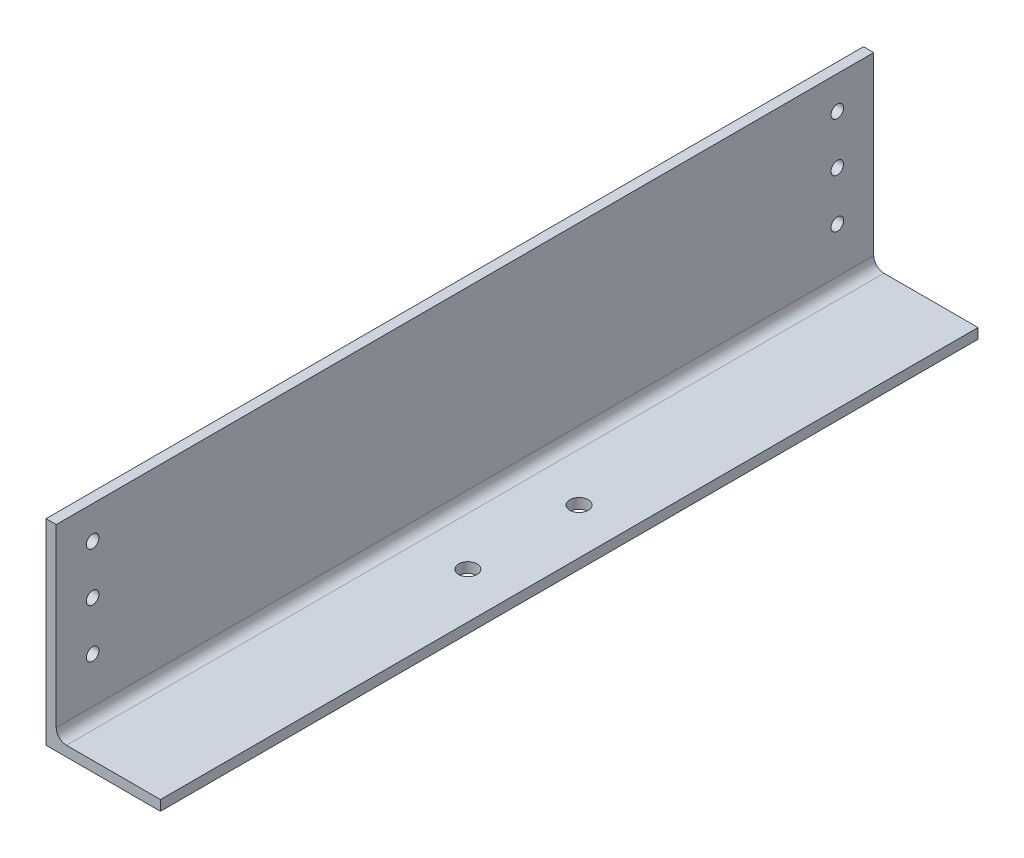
ISO-10303-21;
HEADER;
FILE_DESCRIPTION(('STEP AP214'),'2;1');
FILE_NAME('part.step','',(''),(''),'','','');
FILE_SCHEMA(('AUTOMOTIVE_DESIGN { 1 0 10303 214 1 1 1 1 }'));
ENDSEC;
DATA;
#1=APPLICATION_CONTEXT('core data for automotive mechanical design processes');
#2=APPLICATION_PROTOCOL_DEFINITION('international standard','automotive_design',2000,#1);
#3=PRODUCT_CONTEXT('',#1,'mechanical');
#4=PRODUCT('Part','Part','',(#3));
#5=PRODUCT_RELATED_PRODUCT_CATEGORY('part','',(#4));
#6=PRODUCT_DEFINITION_FORMATION('','',#4);
#7=PRODUCT_DEFINITION_CONTEXT('part definition',#1,'design');
#8=PRODUCT_DEFINITION('design','',#6,#7);
#9=PRODUCT_DEFINITION_SHAPE('','',#8);
#10=(LENGTH_UNIT() NAMED_UNIT(*) SI_UNIT(.MILLI.,.METRE.));
#11=(NAMED_UNIT(*) PLANE_ANGLE_UNIT() SI_UNIT($,.RADIAN.));
#12=(NAMED_UNIT(*) SI_UNIT($,.STERADIAN.) SOLID_ANGLE_UNIT());
#13=UNCERTAINTY_MEASURE_WITH_UNIT(LENGTH_MEASURE(1.E-05),#10,'distance_accuracy_value','');
#14=(GEOMETRIC_REPRESENTATION_CONTEXT(3) GLOBAL_UNCERTAINTY_ASSIGNED_CONTEXT((#13)) GLOBAL_UNIT_ASSIGNED_CONTEXT((#10,
#11,#12)) REPRESENTATION_CONTEXT('',''));
#15=CARTESIAN_POINT('',(0.,0.,0.));
#16=DIRECTION('',(0.,0.,1.));
#17=DIRECTION('',(1.,0.,0.));
#18=AXIS2_PLACEMENT_3D('',#15,#16,#17);
#19=CARTESIAN_POINT('',(69.5846982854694,-50.8356037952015,317.5));
#20=DIRECTION('',(0.,1.,0.));
#21=DIRECTION('',(-1.,0.,0.));
#22=AXIS2_PLACEMENT_3D('',#19,#20,#21);
#23=PLANE('',#22);
#24=CARTESIAN_POINT('',(34.0246982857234,-50.8356037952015,-43.18));
#25=DIRECTION('',(0.,1.,0.));
#26=DIRECTION('',(0.,0.,1.));
#27=AXIS2_PLACEMENT_3D('',#24,#25,#26);
#28=CIRCLE('',#27,7.14374999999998);
#29=CARTESIAN_POINT('',(34.0246982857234,-50.8356037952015,-36.03625));
#30=VERTEX_POINT('',#29);
#31=EDGE_CURVE('E150',#30,#30,#28,.T.);
#32=ORIENTED_EDGE('',*,*,#31,.T.);
#33=EDGE_LOOP('',(#32));
#34=FACE_BOUND('',#33,.T.);
#35=CARTESIAN_POINT('',(34.0246982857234,-50.8356037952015,43.18));
#36=DIRECTION('',(0.,1.,0.));
#37=DIRECTION('',(0.,0.,1.));
#38=AXIS2_PLACEMENT_3D('',#35,#36,#37);
#39=CIRCLE('',#38,7.14374999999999);
#40=CARTESIAN_POINT('',(34.0246982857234,-50.8356037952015,50.32375));
#41=VERTEX_POINT('',#40);
#42=EDGE_CURVE('E156',#41,#41,#39,.T.);
#43=ORIENTED_EDGE('',*,*,#42,.T.);
#44=EDGE_LOOP('',(#43));
#45=FACE_BOUND('',#44,.T.);
#46=DIRECTION('',(1.,0.,0.));
#47=VECTOR('',#46,1.);
#48=CARTESIAN_POINT('',(69.5846982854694,-50.8356037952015,-317.5));
#49=LINE('',#48,#47);
#50=CARTESIAN_POINT('',(-19.3153017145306,-50.8356037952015,-317.5));
#51=VERTEX_POINT('',#50);
#52=CARTESIAN_POINT('',(69.5846982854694,-50.8356037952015,-317.5));
#53=VERTEX_POINT('',#52);
#54=EDGE_CURVE('E127',#51,#53,#49,.T.);
#55=ORIENTED_EDGE('',*,*,#54,.T.);
#56=DIRECTION('',(0.,0.,-1.));
#57=VECTOR('',#56,1.);
#58=CARTESIAN_POINT('',(69.5846982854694,-50.8356037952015,317.5));
#59=LINE('',#58,#57);
#60=CARTESIAN_POINT('',(69.5846982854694,-50.8356037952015,317.5));
#61=VERTEX_POINT('',#60);
#62=EDGE_CURVE('E11',#61,#53,#59,.T.);
#63=ORIENTED_EDGE('',*,*,#62,.F.);
#64=DIRECTION('',(1.,0.,0.));
#65=VECTOR('',#64,1.);
#66=CARTESIAN_POINT('',(69.5846982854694,-50.8356037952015,317.5));
#67=LINE('',#66,#65);
#68=CARTESIAN_POINT('',(-19.3153017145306,-50.8356037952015,317.5));
#69=VERTEX_POINT('',#68);
#70=EDGE_CURVE('E140',#69,#61,#67,.T.);
#71=ORIENTED_EDGE('',*,*,#70,.F.);
#72=DIRECTION('',(0.,0.,-1.));
#73=VECTOR('',#72,1.);
#74=CARTESIAN_POINT('',(-19.3153017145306,-50.8356037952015,317.5));
#75=LINE('',#74,#73);
#76=EDGE_CURVE('E123',#69,#51,#75,.T.);
#77=ORIENTED_EDGE('',*,*,#76,.T.);
#78=EDGE_LOOP('',(#55,#63,#71,#77));
#79=FACE_BOUND('',#78,.T.);
#80=ADVANCED_FACE('F35',(#34,#45,#79),#23,.F.);
#81=CARTESIAN_POINT('',(69.5846982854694,-50.8356037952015,317.5));
#82=DIRECTION('',(-1.,0.,0.));
#83=DIRECTION('',(0.,0.,1.));
#84=AXIS2_PLACEMENT_3D('',#81,#82,#83);
#85=PLANE('',#84);
#86=DIRECTION('',(0.,1.,0.));
#87=VECTOR('',#86,1.);
#88=CARTESIAN_POINT('',(69.5846982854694,-50.8356037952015,-317.5));
#89=LINE('',#88,#87);
#90=CARTESIAN_POINT('',(69.5846982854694,-42.9108037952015,-317.5));
#91=VERTEX_POINT('',#90);
#92=EDGE_CURVE('E130',#53,#91,#89,.T.);
#93=ORIENTED_EDGE('',*,*,#92,.T.);
#94=DIRECTION('',(0.,0.,-1.));
#95=VECTOR('',#94,1.);
#96=CARTESIAN_POINT('',(69.5846982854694,-42.9108037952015,317.5));
#97=LINE('',#96,#95);
#98=CARTESIAN_POINT('',(69.5846982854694,-42.9108037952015,317.5));
#99=VERTEX_POINT('',#98);
#100=EDGE_CURVE('E44',#99,#91,#97,.T.);
#101=ORIENTED_EDGE('',*,*,#100,.F.);
#102=DIRECTION('',(0.,1.,0.));
#103=VECTOR('',#102,1.);
#104=CARTESIAN_POINT('',(69.5846982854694,-50.8356037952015,317.5));
#105=LINE('',#104,#103);
#106=EDGE_CURVE('E93',#61,#99,#105,.T.);
#107=ORIENTED_EDGE('',*,*,#106,.F.);
#108=ORIENTED_EDGE('',*,*,#62,.T.);
#109=EDGE_LOOP('',(#93,#101,#107,#108));
#110=FACE_BOUND('',#109,.T.);
#111=ADVANCED_FACE('F227',(#110),#85,.F.);
#112=CARTESIAN_POINT('',(-3.46570171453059,-42.9108037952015,317.5));
#113=DIRECTION('',(0.,-1.,0.));
#114=DIRECTION('',(0.,0.,-1.));
#115=AXIS2_PLACEMENT_3D('',#112,#113,#114);
#116=PLANE('',#115);
#117=CARTESIAN_POINT('',(34.0246982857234,-42.9108037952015,-43.18));
#118=DIRECTION('',(0.,-1.,0.));
#119=DIRECTION('',(0.,0.,-1.));
#120=AXIS2_PLACEMENT_3D('',#117,#118,#119);
#121=CIRCLE('',#120,7.14374999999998);
#122=CARTESIAN_POINT('',(34.0246982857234,-42.9108037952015,-50.32375));
#123=VERTEX_POINT('',#122);
#124=EDGE_CURVE('E38',#123,#123,#121,.T.);
#125=ORIENTED_EDGE('',*,*,#124,.T.);
#126=EDGE_LOOP('',(#125));
#127=FACE_BOUND('',#126,.T.);
#128=CARTESIAN_POINT('',(34.0246982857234,-42.9108037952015,43.18));
#129=DIRECTION('',(0.,-1.,0.));
#130=DIRECTION('',(0.,0.,-1.));
#131=AXIS2_PLACEMENT_3D('',#128,#129,#130);
#132=CIRCLE('',#131,7.14374999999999);
#133=CARTESIAN_POINT('',(34.0246982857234,-42.9108037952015,36.03625));
#134=VERTEX_POINT('',#133);
#135=EDGE_CURVE('E148',#134,#134,#132,.T.);
#136=ORIENTED_EDGE('',*,*,#135,.T.);
#137=EDGE_LOOP('',(#136));
#138=FACE_BOUND('',#137,.T.);
#139=DIRECTION('',(-1.,0.,0.));
#140=VECTOR('',#139,1.);
#141=CARTESIAN_POINT('',(-3.46570171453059,-42.9108037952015,-317.5));
#142=LINE('',#141,#140);
#143=CARTESIAN_POINT('',(-3.46570171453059,-42.9108037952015,-317.5));
#144=VERTEX_POINT('',#143);
#145=EDGE_CURVE('E133',#91,#144,#142,.T.);
#146=ORIENTED_EDGE('',*,*,#145,.T.);
#147=DIRECTION('',(0.,0.,-1.));
#148=VECTOR('',#147,1.);
#149=CARTESIAN_POINT('',(-3.46570171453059,-42.9108037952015,317.5));
#150=LINE('',#149,#148);
#151=CARTESIAN_POINT('',(-3.46570171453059,-42.9108037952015,317.5));
#152=VERTEX_POINT('',#151);
#153=EDGE_CURVE('E144',#152,#144,#150,.T.);
#154=ORIENTED_EDGE('',*,*,#153,.F.);
#155=DIRECTION('',(-1.,0.,0.));
#156=VECTOR('',#155,1.);
#157=CARTESIAN_POINT('',(-3.46570171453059,-42.9108037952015,317.5));
#158=LINE('',#157,#156);
#159=EDGE_CURVE('E199',#99,#152,#158,.T.);
#160=ORIENTED_EDGE('',*,*,#159,.F.);
#161=ORIENTED_EDGE('',*,*,#100,.T.);
#162=EDGE_LOOP('',(#146,#154,#160,#161));
#163=FACE_BOUND('',#162,.T.);
#164=ADVANCED_FACE('F203',(#127,#138,#163),#116,.F.);
#165=CARTESIAN_POINT('',(-3.46570171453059,-34.9860037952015,317.5));
#166=DIRECTION('',(0.,0.,-1.));
#167=DIRECTION('',(-1.,0.,0.));
#168=AXIS2_PLACEMENT_3D('',#165,#166,#167);
#169=CYLINDRICAL_SURFACE('',#168,7.9248);
#170=CARTESIAN_POINT('',(-3.46570171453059,-34.9860037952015,-317.5));
#171=DIRECTION('',(0.,0.,-1.));
#172=DIRECTION('',(-1.,0.,0.));
#173=AXIS2_PLACEMENT_3D('',#170,#171,#172);
#174=CIRCLE('',#173,7.9248);
#175=CARTESIAN_POINT('',(-11.3905017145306,-34.9860037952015,-317.5));
#176=VERTEX_POINT('',#175);
#177=EDGE_CURVE('E135',#144,#176,#174,.T.);
#178=ORIENTED_EDGE('',*,*,#177,.T.);
#179=DIRECTION('',(0.,0.,-1.));
#180=VECTOR('',#179,1.);
#181=CARTESIAN_POINT('',(-11.3905017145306,-34.9860037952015,317.5));
#182=LINE('',#181,#180);
#183=CARTESIAN_POINT('',(-11.3905017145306,-34.9860037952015,317.5));
#184=VERTEX_POINT('',#183);
#185=EDGE_CURVE('E118',#184,#176,#182,.T.);
#186=ORIENTED_EDGE('',*,*,#185,.F.);
#187=CARTESIAN_POINT('',(-3.46570171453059,-34.9860037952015,317.5));
#188=DIRECTION('',(0.,0.,-1.));
#189=DIRECTION('',(-1.,0.,0.));
#190=AXIS2_PLACEMENT_3D('',#187,#188,#189);
#191=CIRCLE('',#190,7.9248);
#192=EDGE_CURVE('E109',#152,#184,#191,.T.);
#193=ORIENTED_EDGE('',*,*,#192,.F.);
#194=ORIENTED_EDGE('',*,*,#153,.T.);
#195=EDGE_LOOP('',(#178,#186,#193,#194));
#196=FACE_BOUND('',#195,.T.);
#197=ADVANCED_FACE('F207',(#196),#169,.F.);
#198=CARTESIAN_POINT('',(-11.3905017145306,101.564396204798,317.5));
#199=DIRECTION('',(-1.,0.,0.));
#200=DIRECTION('',(0.,-1.,0.));
#201=AXIS2_PLACEMENT_3D('',#198,#199,#200);
#202=PLANE('',#201);
#203=CARTESIAN_POINT('',(-11.3905017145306,38.2649225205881,289.199113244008));
#204=DIRECTION('',(-1.,0.,0.));
#205=DIRECTION('',(0.,-1.,0.));
#206=AXIS2_PLACEMENT_3D('',#203,#204,#205);
#207=CIRCLE('',#206,4.90219999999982);
#208=CARTESIAN_POINT('',(-11.3905017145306,38.2649225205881,284.296913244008));
#209=VERTEX_POINT('',#208);
#210=EDGE_CURVE('E131',#209,#209,#207,.T.);
#211=ORIENTED_EDGE('',*,*,#210,.T.);
#212=EDGE_LOOP('',(#211));
#213=FACE_BOUND('',#212,.T.);
#214=CARTESIAN_POINT('',(-11.3905017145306,0.365448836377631,289.199113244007));
#215=DIRECTION('',(-1.,0.,0.));
#216=DIRECTION('',(0.,-1.,0.));
#217=AXIS2_PLACEMENT_3D('',#214,#215,#216);
#218=CIRCLE('',#217,4.90220000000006);
#219=CARTESIAN_POINT('',(-11.3905017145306,0.365448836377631,284.296913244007));
#220=VERTEX_POINT('',#219);
#221=EDGE_CURVE('E192',#220,#220,#218,.T.);
#222=ORIENTED_EDGE('',*,*,#221,.T.);
#223=EDGE_LOOP('',(#222));
#224=FACE_BOUND('',#223,.T.);
#225=CARTESIAN_POINT('',(-11.3905017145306,76.1643962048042,-289.199113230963));
#226=DIRECTION('',(-1.,0.,0.));
#227=DIRECTION('',(0.,-1.,0.));
#228=AXIS2_PLACEMENT_3D('',#225,#226,#227);
#229=CIRCLE('',#228,4.9022);
#230=CARTESIAN_POINT('',(-11.3905017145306,76.1643962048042,-294.101313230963));
#231=VERTEX_POINT('',#230);
#232=EDGE_CURVE('E189',#231,#231,#229,.T.);
#233=ORIENTED_EDGE('',*,*,#232,.T.);
#234=EDGE_LOOP('',(#233));
#235=FACE_BOUND('',#234,.T.);
#236=CARTESIAN_POINT('',(-11.3905017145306,38.2649225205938,-289.199113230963));
#237=DIRECTION('',(-1.,0.,0.));
#238=DIRECTION('',(0.,-1.,0.));
#239=AXIS2_PLACEMENT_3D('',#236,#237,#238);
#240=CIRCLE('',#239,4.9022);
#241=CARTESIAN_POINT('',(-11.3905017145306,38.2649225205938,-294.101313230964));
#242=VERTEX_POINT('',#241);
#243=EDGE_CURVE('E186',#242,#242,#240,.T.);
#244=ORIENTED_EDGE('',*,*,#243,.T.);
#245=EDGE_LOOP('',(#244));
#246=FACE_BOUND('',#245,.T.);
#247=CARTESIAN_POINT('',(-11.3905017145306,0.365448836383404,-289.199113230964));
#248=DIRECTION('',(-1.,0.,0.));
#249=DIRECTION('',(0.,-1.,0.));
#250=AXIS2_PLACEMENT_3D('',#247,#248,#249);
#251=CIRCLE('',#250,4.90220000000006);
#252=CARTESIAN_POINT('',(-11.3905017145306,0.365448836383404,-294.101313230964));
#253=VERTEX_POINT('',#252);
#254=EDGE_CURVE('E183',#253,#253,#251,.T.);
#255=ORIENTED_EDGE('',*,*,#254,.T.);
#256=EDGE_LOOP('',(#255));
#257=FACE_BOUND('',#256,.T.);
#258=CARTESIAN_POINT('',(-11.3905017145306,76.1643962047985,289.199113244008));
#259=DIRECTION('',(-1.,0.,0.));
#260=DIRECTION('',(0.,-1.,0.));
#261=AXIS2_PLACEMENT_3D('',#258,#259,#260);
#262=CIRCLE('',#261,4.9022);
#263=CARTESIAN_POINT('',(-11.3905017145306,76.1643962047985,284.296913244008));
#264=VERTEX_POINT('',#263);
#265=EDGE_CURVE('E180',#264,#264,#262,.T.);
#266=ORIENTED_EDGE('',*,*,#265,.T.);
#267=EDGE_LOOP('',(#266));
#268=FACE_BOUND('',#267,.T.);
#269=DIRECTION('',(0.,1.,0.));
#270=VECTOR('',#269,1.);
#271=CARTESIAN_POINT('',(-11.3905017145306,101.564396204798,-317.5));
#272=LINE('',#271,#270);
#273=CARTESIAN_POINT('',(-11.3905017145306,101.564396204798,-317.5));
#274=VERTEX_POINT('',#273);
#275=EDGE_CURVE('E117',#176,#274,#272,.T.);
#276=ORIENTED_EDGE('',*,*,#275,.T.);
#277=DIRECTION('',(0.,0.,-1.));
#278=VECTOR('',#277,1.);
#279=CARTESIAN_POINT('',(-11.3905017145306,101.564396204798,317.5));
#280=LINE('',#279,#278);
#281=CARTESIAN_POINT('',(-11.3905017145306,101.564396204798,317.5));
#282=VERTEX_POINT('',#281);
#283=EDGE_CURVE('E114',#282,#274,#280,.T.);
#284=ORIENTED_EDGE('',*,*,#283,.F.);
#285=DIRECTION('',(0.,1.,0.));
#286=VECTOR('',#285,1.);
#287=CARTESIAN_POINT('',(-11.3905017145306,101.564396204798,317.5));
#288=LINE('',#287,#286);
#289=EDGE_CURVE('E103',#184,#282,#288,.T.);
#290=ORIENTED_EDGE('',*,*,#289,.F.);
#291=ORIENTED_EDGE('',*,*,#185,.T.);
#292=EDGE_LOOP('',(#276,#284,#290,#291));
#293=FACE_BOUND('',#292,.T.);
#294=ADVANCED_FACE('F115',(#213,#224,#235,#246,#257,#268,#293),#202,.F.);
#295=CARTESIAN_POINT('',(-19.3153017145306,101.564396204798,317.5));
#296=DIRECTION('',(0.,-1.,0.));
#297=DIRECTION('',(0.,0.,-1.));
#298=AXIS2_PLACEMENT_3D('',#295,#296,#297);
#299=PLANE('',#298);
#300=DIRECTION('',(-1.,0.,0.));
#301=VECTOR('',#300,1.);
#302=CARTESIAN_POINT('',(-19.3153017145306,101.564396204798,-317.5));
#303=LINE('',#302,#301);
#304=CARTESIAN_POINT('',(-19.3153017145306,101.564396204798,-317.5));
#305=VERTEX_POINT('',#304);
#306=EDGE_CURVE('E79',#274,#305,#303,.T.);
#307=ORIENTED_EDGE('',*,*,#306,.T.);
#308=DIRECTION('',(0.,0.,-1.));
#309=VECTOR('',#308,1.);
#310=CARTESIAN_POINT('',(-19.3153017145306,101.564396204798,317.5));
#311=LINE('',#310,#309);
#312=CARTESIAN_POINT('',(-19.3153017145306,101.564396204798,317.5));
#313=VERTEX_POINT('',#312);
#314=EDGE_CURVE('E119',#313,#305,#311,.T.);
#315=ORIENTED_EDGE('',*,*,#314,.F.);
#316=DIRECTION('',(-1.,0.,0.));
#317=VECTOR('',#316,1.);
#318=CARTESIAN_POINT('',(-19.3153017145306,101.564396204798,317.5));
#319=LINE('',#318,#317);
#320=EDGE_CURVE('E107',#282,#313,#319,.T.);
#321=ORIENTED_EDGE('',*,*,#320,.F.);
#322=ORIENTED_EDGE('',*,*,#283,.T.);
#323=EDGE_LOOP('',(#307,#315,#321,#322));
#324=FACE_BOUND('',#323,.T.);
#325=ADVANCED_FACE('F121',(#324),#299,.F.);
#326=CARTESIAN_POINT('',(-19.3153017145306,-50.8356037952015,317.5));
#327=DIRECTION('',(1.,0.,0.));
#328=DIRECTION('',(0.,1.,0.));
#329=AXIS2_PLACEMENT_3D('',#326,#327,#328);
#330=PLANE('',#329);
#331=CARTESIAN_POINT('',(-19.3153017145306,38.2649225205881,289.199113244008));
#332=DIRECTION('',(1.,0.,0.));
#333=DIRECTION('',(0.,0.,-1.));
#334=AXIS2_PLACEMENT_3D('',#331,#332,#333);
#335=CIRCLE('',#334,4.90219999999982);
#336=CARTESIAN_POINT('',(-19.3153017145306,38.2649225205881,284.296913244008));
#337=VERTEX_POINT('',#336);
#338=EDGE_CURVE('E166',#337,#337,#335,.T.);
#339=ORIENTED_EDGE('',*,*,#338,.T.);
#340=EDGE_LOOP('',(#339));
#341=FACE_BOUND('',#340,.T.);
#342=CARTESIAN_POINT('',(-19.3153017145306,0.365448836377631,289.199113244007));
#343=DIRECTION('',(1.,0.,0.));
#344=DIRECTION('',(0.,0.,-1.));
#345=AXIS2_PLACEMENT_3D('',#342,#343,#344);
#346=CIRCLE('',#345,4.90220000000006);
#347=CARTESIAN_POINT('',(-19.3153017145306,0.365448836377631,284.296913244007));
#348=VERTEX_POINT('',#347);
#349=EDGE_CURVE('E170',#348,#348,#346,.T.);
#350=ORIENTED_EDGE('',*,*,#349,.T.);
#351=EDGE_LOOP('',(#350));
#352=FACE_BOUND('',#351,.T.);
#353=CARTESIAN_POINT('',(-19.3153017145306,76.1643962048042,-289.199113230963));
#354=DIRECTION('',(1.,0.,0.));
#355=DIRECTION('',(0.,0.,-1.));
#356=AXIS2_PLACEMENT_3D('',#353,#354,#355);
#357=CIRCLE('',#356,4.9022);
#358=CARTESIAN_POINT('',(-19.3153017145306,76.1643962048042,-294.101313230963));
#359=VERTEX_POINT('',#358);
#360=EDGE_CURVE('E173',#359,#359,#357,.T.);
#361=ORIENTED_EDGE('',*,*,#360,.T.);
#362=EDGE_LOOP('',(#361));
#363=FACE_BOUND('',#362,.T.);
#364=CARTESIAN_POINT('',(-19.3153017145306,38.2649225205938,-289.199113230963));
#365=DIRECTION('',(1.,0.,0.));
#366=DIRECTION('',(0.,0.,-1.));
#367=AXIS2_PLACEMENT_3D('',#364,#365,#366);
#368=CIRCLE('',#367,4.9022);
#369=CARTESIAN_POINT('',(-19.3153017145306,38.2649225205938,-294.101313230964));
#370=VERTEX_POINT('',#369);
#371=EDGE_CURVE('E165',#370,#370,#368,.T.);
#372=ORIENTED_EDGE('',*,*,#371,.T.);
#373=EDGE_LOOP('',(#372));
#374=FACE_BOUND('',#373,.T.);
#375=CARTESIAN_POINT('',(-19.3153017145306,0.365448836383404,-289.199113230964));
#376=DIRECTION('',(1.,0.,0.));
#377=DIRECTION('',(0.,0.,-1.));
#378=AXIS2_PLACEMENT_3D('',#375,#376,#377);
#379=CIRCLE('',#378,4.90220000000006);
#380=CARTESIAN_POINT('',(-19.3153017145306,0.365448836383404,-294.101313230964));
#381=VERTEX_POINT('',#380);
#382=EDGE_CURVE('E154',#381,#381,#379,.T.);
#383=ORIENTED_EDGE('',*,*,#382,.T.);
#384=EDGE_LOOP('',(#383));
#385=FACE_BOUND('',#384,.T.);
#386=CARTESIAN_POINT('',(-19.3153017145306,76.1643962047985,289.199113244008));
#387=DIRECTION('',(1.,0.,0.));
#388=DIRECTION('',(0.,0.,-1.));
#389=AXIS2_PLACEMENT_3D('',#386,#387,#388);
#390=CIRCLE('',#389,4.9022);
#391=CARTESIAN_POINT('',(-19.3153017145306,76.1643962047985,284.296913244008));
#392=VERTEX_POINT('',#391);
#393=EDGE_CURVE('E169',#392,#392,#390,.T.);
#394=ORIENTED_EDGE('',*,*,#393,.T.);
#395=EDGE_LOOP('',(#394));
#396=FACE_BOUND('',#395,.T.);
#397=DIRECTION('',(0.,-1.,0.));
#398=VECTOR('',#397,1.);
#399=CARTESIAN_POINT('',(-19.3153017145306,-50.8356037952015,-317.5));
#400=LINE('',#399,#398);
#401=EDGE_CURVE('E85',#305,#51,#400,.T.);
#402=ORIENTED_EDGE('',*,*,#401,.T.);
#403=ORIENTED_EDGE('',*,*,#76,.F.);
#404=DIRECTION('',(0.,-1.,0.));
#405=VECTOR('',#404,1.);
#406=CARTESIAN_POINT('',(-19.3153017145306,-50.8356037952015,317.5));
#407=LINE('',#406,#405);
#408=EDGE_CURVE('E53',#313,#69,#407,.T.);
#409=ORIENTED_EDGE('',*,*,#408,.F.);
#410=ORIENTED_EDGE('',*,*,#314,.T.);
#411=EDGE_LOOP('',(#402,#403,#409,#410));
#412=FACE_BOUND('',#411,.T.);
#413=ADVANCED_FACE('F214',(#341,#352,#363,#374,#385,#396,#412),#330,.F.);
#414=CARTESIAN_POINT('',(-3.46570171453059,-34.9860037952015,317.5));
#415=DIRECTION('',(0.,0.,-1.));
#416=DIRECTION('',(-1.,0.,0.));
#417=AXIS2_PLACEMENT_3D('',#414,#415,#416);
#418=PLANE('',#417);
#419=ORIENTED_EDGE('',*,*,#70,.T.);
#420=ORIENTED_EDGE('',*,*,#106,.T.);
#421=ORIENTED_EDGE('',*,*,#159,.T.);
#422=ORIENTED_EDGE('',*,*,#192,.T.);
#423=ORIENTED_EDGE('',*,*,#289,.T.);
#424=ORIENTED_EDGE('',*,*,#320,.T.);
#425=ORIENTED_EDGE('',*,*,#408,.T.);
#426=EDGE_LOOP('',(#419,#420,#421,#422,#423,#424,#425));
#427=FACE_BOUND('',#426,.T.);
#428=ADVANCED_FACE('F105',(#427),#418,.F.);
#429=CARTESIAN_POINT('',(-3.46570171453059,-34.9860037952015,-317.5));
#430=DIRECTION('',(0.,0.,-1.));
#431=DIRECTION('',(-1.,0.,0.));
#432=AXIS2_PLACEMENT_3D('',#429,#430,#431);
#433=PLANE('',#432);
#434=ORIENTED_EDGE('',*,*,#54,.F.);
#435=ORIENTED_EDGE('',*,*,#401,.F.);
#436=ORIENTED_EDGE('',*,*,#306,.F.);
#437=ORIENTED_EDGE('',*,*,#275,.F.);
#438=ORIENTED_EDGE('',*,*,#177,.F.);
#439=ORIENTED_EDGE('',*,*,#145,.F.);
#440=ORIENTED_EDGE('',*,*,#92,.F.);
#441=EDGE_LOOP('',(#434,#435,#436,#437,#438,#439,#440));
#442=FACE_BOUND('',#441,.T.);
#443=ADVANCED_FACE('F210',(#442),#433,.T.);
#444=CARTESIAN_POINT('',(-19.3153017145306,76.1643962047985,289.199113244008));
#445=DIRECTION('',(1.,0.,0.));
#446=DIRECTION('',(0.,0.,-1.));
#447=AXIS2_PLACEMENT_3D('',#444,#445,#446);
#448=CYLINDRICAL_SURFACE('',#447,4.9022);
#449=CARTESIAN_POINT('',(-19.3153017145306,76.1643962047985,284.296913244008));
#450=CARTESIAN_POINT('',(-19.2327517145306,76.1643962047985,284.296913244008));
#451=CARTESIAN_POINT('',(-19.1502017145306,76.1643962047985,284.296913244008));
#452=CARTESIAN_POINT('',(-18.9851017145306,76.1643962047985,284.296913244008));
#453=CARTESIAN_POINT('',(-18.9025517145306,76.1643962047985,284.296913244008));
#454=CARTESIAN_POINT('',(-18.7374517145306,76.1643962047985,284.296913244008));
#455=CARTESIAN_POINT('',(-18.6549017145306,76.1643962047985,284.296913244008));
#456=CARTESIAN_POINT('',(-18.4898017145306,76.1643962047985,284.296913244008));
#457=CARTESIAN_POINT('',(-18.4072517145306,76.1643962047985,284.296913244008));
#458=CARTESIAN_POINT('',(-18.2421517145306,76.1643962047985,284.296913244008));
#459=CARTESIAN_POINT('',(-18.1596017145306,76.1643962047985,284.296913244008));
#460=CARTESIAN_POINT('',(-17.9945017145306,76.1643962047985,284.296913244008));
#461=CARTESIAN_POINT('',(-17.9119517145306,76.1643962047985,284.296913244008));
#462=CARTESIAN_POINT('',(-17.7468517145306,76.1643962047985,284.296913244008));
#463=CARTESIAN_POINT('',(-17.6643017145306,76.1643962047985,284.296913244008));
#464=CARTESIAN_POINT('',(-17.4992017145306,76.1643962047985,284.296913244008));
#465=CARTESIAN_POINT('',(-17.4166517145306,76.1643962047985,284.296913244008));
#466=CARTESIAN_POINT('',(-17.2515517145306,76.1643962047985,284.296913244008));
#467=CARTESIAN_POINT('',(-17.1690017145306,76.1643962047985,284.296913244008));
#468=CARTESIAN_POINT('',(-17.0039017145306,76.1643962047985,284.296913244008));
#469=CARTESIAN_POINT('',(-16.9213517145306,76.1643962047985,284.296913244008));
#470=CARTESIAN_POINT('',(-16.7562517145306,76.1643962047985,284.296913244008));
#471=CARTESIAN_POINT('',(-16.6737017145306,76.1643962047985,284.296913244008));
#472=CARTESIAN_POINT('',(-16.5086017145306,76.1643962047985,284.296913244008));
#473=CARTESIAN_POINT('',(-16.4260517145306,76.1643962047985,284.296913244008));
#474=CARTESIAN_POINT('',(-16.2609517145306,76.1643962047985,284.296913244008));
#475=CARTESIAN_POINT('',(-16.1784017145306,76.1643962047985,284.296913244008));
#476=CARTESIAN_POINT('',(-16.0133017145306,76.1643962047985,284.296913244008));
#477=CARTESIAN_POINT('',(-15.9307517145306,76.1643962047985,284.296913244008));
#478=CARTESIAN_POINT('',(-15.7656517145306,76.1643962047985,284.296913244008));
#479=CARTESIAN_POINT('',(-15.6831017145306,76.1643962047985,284.296913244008));
#480=CARTESIAN_POINT('',(-15.5180017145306,76.1643962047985,284.296913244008));
#481=CARTESIAN_POINT('',(-15.4354517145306,76.1643962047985,284.296913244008));
#482=CARTESIAN_POINT('',(-15.2703517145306,76.1643962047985,284.296913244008));
#483=CARTESIAN_POINT('',(-15.1878017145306,76.1643962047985,284.296913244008));
#484=CARTESIAN_POINT('',(-15.0227017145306,76.1643962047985,284.296913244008));
#485=CARTESIAN_POINT('',(-14.9401517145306,76.1643962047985,284.296913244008));
#486=CARTESIAN_POINT('',(-14.7750517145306,76.1643962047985,284.296913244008));
#487=CARTESIAN_POINT('',(-14.6925017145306,76.1643962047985,284.296913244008));
#488=CARTESIAN_POINT('',(-14.5274017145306,76.1643962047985,284.296913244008));
#489=CARTESIAN_POINT('',(-14.4448517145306,76.1643962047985,284.296913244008));
#490=CARTESIAN_POINT('',(-14.2797517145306,76.1643962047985,284.296913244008));
#491=CARTESIAN_POINT('',(-14.1972017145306,76.1643962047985,284.296913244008));
#492=CARTESIAN_POINT('',(-14.0321017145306,76.1643962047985,284.296913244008));
#493=CARTESIAN_POINT('',(-13.9495517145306,76.1643962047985,284.296913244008));
#494=CARTESIAN_POINT('',(-13.7844517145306,76.1643962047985,284.296913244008));
#495=CARTESIAN_POINT('',(-13.7019017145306,76.1643962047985,284.296913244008));
#496=CARTESIAN_POINT('',(-13.5368017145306,76.1643962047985,284.296913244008));
#497=CARTESIAN_POINT('',(-13.4542517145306,76.1643962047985,284.296913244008));
#498=CARTESIAN_POINT('',(-13.2891517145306,76.1643962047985,284.296913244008));
#499=CARTESIAN_POINT('',(-13.2066017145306,76.1643962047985,284.296913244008));
#500=CARTESIAN_POINT('',(-13.0415017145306,76.1643962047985,284.296913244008));
#501=CARTESIAN_POINT('',(-12.9589517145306,76.1643962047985,284.296913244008));
#502=CARTESIAN_POINT('',(-12.7938517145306,76.1643962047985,284.296913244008));
#503=CARTESIAN_POINT('',(-12.7113017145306,76.1643962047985,284.296913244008));
#504=CARTESIAN_POINT('',(-12.5462017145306,76.1643962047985,284.296913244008));
#505=CARTESIAN_POINT('',(-12.4636517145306,76.1643962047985,284.296913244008));
#506=CARTESIAN_POINT('',(-12.2985517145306,76.1643962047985,284.296913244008));
#507=CARTESIAN_POINT('',(-12.2160017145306,76.1643962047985,284.296913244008));
#508=CARTESIAN_POINT('',(-12.0509017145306,76.1643962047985,284.296913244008));
#509=CARTESIAN_POINT('',(-11.9683517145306,76.1643962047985,284.296913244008));
#510=CARTESIAN_POINT('',(-11.8032517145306,76.1643962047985,284.296913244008));
#511=CARTESIAN_POINT('',(-11.7207017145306,76.1643962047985,284.296913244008));
#512=CARTESIAN_POINT('',(-11.5556017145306,76.1643962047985,284.296913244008));
#513=CARTESIAN_POINT('',(-11.4730517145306,76.1643962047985,284.296913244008));
#514=CARTESIAN_POINT('',(-11.3905017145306,76.1643962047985,284.296913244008));
#515=B_SPLINE_CURVE_WITH_KNOTS('',3,(#449,#450,#451,#452,#453,#454,#455,#456,#457,#458,#459,
#460,#461,#462,#463,#464,#465,#466,#467,#468,#469,#470,#471,#472,#473,#474,#475,#476,#477,#478,
#479,#480,#481,#482,#483,#484,#485,#486,#487,#488,#489,#490,#491,#492,#493,#494,#495,#496,#497,
#498,#499,#500,#501,#502,#503,#504,#505,#506,#507,#508,#509,#510,#511,#512,#513,#514),
.UNSPECIFIED.,.F.,.F.,(4,2,2,2,2,2,2,2,2,2,2,2,2,2,2,2,2,2,2,2,2,2,2,2,2,2,2,2,2,2,2,2,4),(0.,
0.247649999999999,0.495299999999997,0.742949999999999,0.990599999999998,1.23825,1.4859,1.73355,
1.9812,2.22885,2.4765,2.72415,2.9718,3.21945,3.4671,3.71475,3.9624,4.21005,4.4577,4.70535,4.953,
5.20065,5.4483,5.69595,5.9436,6.19125,6.4389,6.68655,6.9342,7.18185,7.4295,7.67715,7.9248),.UNSPECIFIED.);
#516=EDGE_CURVE('BSEAM253',#392,#264,#515,.T.);
#517=ORIENTED_EDGE('',*,*,#393,.F.);
#518=ORIENTED_EDGE('',*,*,#265,.F.);
#519=ORIENTED_EDGE('',*,*,#516,.T.);
#520=ORIENTED_EDGE('',*,*,#516,.F.);
#521=EDGE_LOOP('',(#517,#519,#518,#520));
#522=FACE_BOUND('',#521,.T.);
#523=ADVANCED_FACE('F253',(#522),#448,.F.);
#524=CARTESIAN_POINT('',(-19.3153017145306,0.365448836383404,-289.199113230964));
#525=DIRECTION('',(1.,0.,0.));
#526=DIRECTION('',(0.,0.,-1.));
#527=AXIS2_PLACEMENT_3D('',#524,#525,#526);
#528=CYLINDRICAL_SURFACE('',#527,4.90220000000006);
#529=CARTESIAN_POINT('',(-19.3153017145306,0.365448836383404,-294.101313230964));
#530=CARTESIAN_POINT('',(-19.2327517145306,0.365448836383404,-294.101313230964));
#531=CARTESIAN_POINT('',(-19.1502017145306,0.365448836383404,-294.101313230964));
#532=CARTESIAN_POINT('',(-18.9851017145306,0.365448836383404,-294.101313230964));
#533=CARTESIAN_POINT('',(-18.9025517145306,0.365448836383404,-294.101313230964));
#534=CARTESIAN_POINT('',(-18.7374517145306,0.365448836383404,-294.101313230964));
#535=CARTESIAN_POINT('',(-18.6549017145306,0.365448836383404,-294.101313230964));
#536=CARTESIAN_POINT('',(-18.4898017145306,0.365448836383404,-294.101313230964));
#537=CARTESIAN_POINT('',(-18.4072517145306,0.365448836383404,-294.101313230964));
#538=CARTESIAN_POINT('',(-18.2421517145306,0.365448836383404,-294.101313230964));
#539=CARTESIAN_POINT('',(-18.1596017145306,0.365448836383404,-294.101313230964));
#540=CARTESIAN_POINT('',(-17.9945017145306,0.365448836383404,-294.101313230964));
#541=CARTESIAN_POINT('',(-17.9119517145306,0.365448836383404,-294.101313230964));
#542=CARTESIAN_POINT('',(-17.7468517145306,0.365448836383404,-294.101313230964));
#543=CARTESIAN_POINT('',(-17.6643017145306,0.365448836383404,-294.101313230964));
#544=CARTESIAN_POINT('',(-17.4992017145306,0.365448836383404,-294.101313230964));
#545=CARTESIAN_POINT('',(-17.4166517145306,0.365448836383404,-294.101313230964));
#546=CARTESIAN_POINT('',(-17.2515517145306,0.365448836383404,-294.101313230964));
#547=CARTESIAN_POINT('',(-17.1690017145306,0.365448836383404,-294.101313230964));
#548=CARTESIAN_POINT('',(-17.0039017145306,0.365448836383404,-294.101313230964));
#549=CARTESIAN_POINT('',(-16.9213517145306,0.365448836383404,-294.101313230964));
#550=CARTESIAN_POINT('',(-16.7562517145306,0.365448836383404,-294.101313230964));
#551=CARTESIAN_POINT('',(-16.6737017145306,0.365448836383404,-294.101313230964));
#552=CARTESIAN_POINT('',(-16.5086017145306,0.365448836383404,-294.101313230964));
#553=CARTESIAN_POINT('',(-16.4260517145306,0.365448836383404,-294.101313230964));
#554=CARTESIAN_POINT('',(-16.2609517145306,0.365448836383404,-294.101313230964));
#555=CARTESIAN_POINT('',(-16.1784017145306,0.365448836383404,-294.101313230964));
#556=CARTESIAN_POINT('',(-16.0133017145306,0.365448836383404,-294.101313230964));
#557=CARTESIAN_POINT('',(-15.9307517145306,0.365448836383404,-294.101313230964));
#558=CARTESIAN_POINT('',(-15.7656517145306,0.365448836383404,-294.101313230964));
#559=CARTESIAN_POINT('',(-15.6831017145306,0.365448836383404,-294.101313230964));
#560=CARTESIAN_POINT('',(-15.5180017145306,0.365448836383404,-294.101313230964));
#561=CARTESIAN_POINT('',(-15.4354517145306,0.365448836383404,-294.101313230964));
#562=CARTESIAN_POINT('',(-15.2703517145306,0.365448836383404,-294.101313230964));
#563=CARTESIAN_POINT('',(-15.1878017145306,0.365448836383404,-294.101313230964));
#564=CARTESIAN_POINT('',(-15.0227017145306,0.365448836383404,-294.101313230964));
#565=CARTESIAN_POINT('',(-14.9401517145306,0.365448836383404,-294.101313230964));
#566=CARTESIAN_POINT('',(-14.7750517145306,0.365448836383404,-294.101313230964));
#567=CARTESIAN_POINT('',(-14.6925017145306,0.365448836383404,-294.101313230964));
#568=CARTESIAN_POINT('',(-14.5274017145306,0.365448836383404,-294.101313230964));
#569=CARTESIAN_POINT('',(-14.4448517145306,0.365448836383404,-294.101313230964));
#570=CARTESIAN_POINT('',(-14.2797517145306,0.365448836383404,-294.101313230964));
#571=CARTESIAN_POINT('',(-14.1972017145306,0.365448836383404,-294.101313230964));
#572=CARTESIAN_POINT('',(-14.0321017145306,0.365448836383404,-294.101313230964));
#573=CARTESIAN_POINT('',(-13.9495517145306,0.365448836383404,-294.101313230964));
#574=CARTESIAN_POINT('',(-13.7844517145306,0.365448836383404,-294.101313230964));
#575=CARTESIAN_POINT('',(-13.7019017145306,0.365448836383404,-294.101313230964));
#576=CARTESIAN_POINT('',(-13.5368017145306,0.365448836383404,-294.101313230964));
#577=CARTESIAN_POINT('',(-13.4542517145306,0.365448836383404,-294.101313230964));
#578=CARTESIAN_POINT('',(-13.2891517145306,0.365448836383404,-294.101313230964));
#579=CARTESIAN_POINT('',(-13.2066017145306,0.365448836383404,-294.101313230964));
#580=CARTESIAN_POINT('',(-13.0415017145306,0.365448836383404,-294.101313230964));
#581=CARTESIAN_POINT('',(-12.9589517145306,0.365448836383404,-294.101313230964));
#582=CARTESIAN_POINT('',(-12.7938517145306,0.365448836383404,-294.101313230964));
#583=CARTESIAN_POINT('',(-12.7113017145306,0.365448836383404,-294.101313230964));
#584=CARTESIAN_POINT('',(-12.5462017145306,0.365448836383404,-294.101313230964));
#585=CARTESIAN_POINT('',(-12.4636517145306,0.365448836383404,-294.101313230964));
#586=CARTESIAN_POINT('',(-12.2985517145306,0.365448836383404,-294.101313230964));
#587=CARTESIAN_POINT('',(-12.2160017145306,0.365448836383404,-294.101313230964));
#588=CARTESIAN_POINT('',(-12.0509017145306,0.365448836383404,-294.101313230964));
#589=CARTESIAN_POINT('',(-11.9683517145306,0.365448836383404,-294.101313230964));
#590=CARTESIAN_POINT('',(-11.8032517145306,0.365448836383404,-294.101313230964));
#591=CARTESIAN_POINT('',(-11.7207017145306,0.365448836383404,-294.101313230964));
#592=CARTESIAN_POINT('',(-11.5556017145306,0.365448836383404,-294.101313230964));
#593=CARTESIAN_POINT('',(-11.4730517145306,0.365448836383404,-294.101313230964));
#594=CARTESIAN_POINT('',(-11.3905017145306,0.365448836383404,-294.101313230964));
#595=B_SPLINE_CURVE_WITH_KNOTS('',3,(#529,#530,#531,#532,#533,#534,#535,#536,#537,#538,#539,
#540,#541,#542,#543,#544,#545,#546,#547,#548,#549,#550,#551,#552,#553,#554,#555,#556,#557,#558,
#559,#560,#561,#562,#563,#564,#565,#566,#567,#568,#569,#570,#571,#572,#573,#574,#575,#576,#577,
#578,#579,#580,#581,#582,#583,#584,#585,#586,#587,#588,#589,#590,#591,#592,#593,#594),
.UNSPECIFIED.,.F.,.F.,(4,2,2,2,2,2,2,2,2,2,2,2,2,2,2,2,2,2,2,2,2,2,2,2,2,2,2,2,2,2,2,2,4),(0.,
0.247649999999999,0.495300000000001,0.742949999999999,0.990600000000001,1.23825,1.4859,1.73355,
1.9812,2.22885,2.4765,2.72415,2.9718,3.21945000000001,3.4671,3.71475,3.96240000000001,
4.21005000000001,4.45770000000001,4.70535000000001,4.95300000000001,5.20065000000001,
5.44830000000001,5.69595000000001,5.94360000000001,6.19125000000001,6.43890000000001,
6.68655000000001,6.93420000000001,7.18185000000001,7.42950000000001,7.67715000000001,
7.92480000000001),.UNSPECIFIED.);
#596=EDGE_CURVE('BSEAM250',#381,#253,#595,.T.);
#597=ORIENTED_EDGE('',*,*,#382,.F.);
#598=ORIENTED_EDGE('',*,*,#254,.F.);
#599=ORIENTED_EDGE('',*,*,#596,.T.);
#600=ORIENTED_EDGE('',*,*,#596,.F.);
#601=EDGE_LOOP('',(#597,#599,#598,#600));
#602=FACE_BOUND('',#601,.T.);
#603=ADVANCED_FACE('F250',(#602),#528,.F.);
#604=CARTESIAN_POINT('',(-19.3153017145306,38.2649225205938,-289.199113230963));
#605=DIRECTION('',(1.,0.,0.));
#606=DIRECTION('',(0.,0.,-1.));
#607=AXIS2_PLACEMENT_3D('',#604,#605,#606);
#608=CYLINDRICAL_SURFACE('',#607,4.9022);
#609=CARTESIAN_POINT('',(-19.3153017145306,38.2649225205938,-294.101313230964));
#610=CARTESIAN_POINT('',(-19.2327517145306,38.2649225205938,-294.101313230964));
#611=CARTESIAN_POINT('',(-19.1502017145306,38.2649225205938,-294.101313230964));
#612=CARTESIAN_POINT('',(-18.9851017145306,38.2649225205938,-294.101313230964));
#613=CARTESIAN_POINT('',(-18.9025517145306,38.2649225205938,-294.101313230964));
#614=CARTESIAN_POINT('',(-18.7374517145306,38.2649225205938,-294.101313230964));
#615=CARTESIAN_POINT('',(-18.6549017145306,38.2649225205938,-294.101313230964));
#616=CARTESIAN_POINT('',(-18.4898017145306,38.2649225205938,-294.101313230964));
#617=CARTESIAN_POINT('',(-18.4072517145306,38.2649225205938,-294.101313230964));
#618=CARTESIAN_POINT('',(-18.2421517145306,38.2649225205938,-294.101313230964));
#619=CARTESIAN_POINT('',(-18.1596017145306,38.2649225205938,-294.101313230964));
#620=CARTESIAN_POINT('',(-17.9945017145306,38.2649225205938,-294.101313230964));
#621=CARTESIAN_POINT('',(-17.9119517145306,38.2649225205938,-294.101313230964));
#622=CARTESIAN_POINT('',(-17.7468517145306,38.2649225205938,-294.101313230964));
#623=CARTESIAN_POINT('',(-17.6643017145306,38.2649225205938,-294.101313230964));
#624=CARTESIAN_POINT('',(-17.4992017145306,38.2649225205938,-294.101313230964));
#625=CARTESIAN_POINT('',(-17.4166517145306,38.2649225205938,-294.101313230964));
#626=CARTESIAN_POINT('',(-17.2515517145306,38.2649225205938,-294.101313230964));
#627=CARTESIAN_POINT('',(-17.1690017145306,38.2649225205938,-294.101313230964));
#628=CARTESIAN_POINT('',(-17.0039017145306,38.2649225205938,-294.101313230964));
#629=CARTESIAN_POINT('',(-16.9213517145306,38.2649225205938,-294.101313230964));
#630=CARTESIAN_POINT('',(-16.7562517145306,38.2649225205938,-294.101313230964));
#631=CARTESIAN_POINT('',(-16.6737017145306,38.2649225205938,-294.101313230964));
#632=CARTESIAN_POINT('',(-16.5086017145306,38.2649225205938,-294.101313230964));
#633=CARTESIAN_POINT('',(-16.4260517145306,38.2649225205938,-294.101313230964));
#634=CARTESIAN_POINT('',(-16.2609517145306,38.2649225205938,-294.101313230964));
#635=CARTESIAN_POINT('',(-16.1784017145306,38.2649225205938,-294.101313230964));
#636=CARTESIAN_POINT('',(-16.0133017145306,38.2649225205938,-294.101313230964));
#637=CARTESIAN_POINT('',(-15.9307517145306,38.2649225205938,-294.101313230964));
#638=CARTESIAN_POINT('',(-15.7656517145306,38.2649225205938,-294.101313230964));
#639=CARTESIAN_POINT('',(-15.6831017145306,38.2649225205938,-294.101313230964));
#640=CARTESIAN_POINT('',(-15.5180017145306,38.2649225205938,-294.101313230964));
#641=CARTESIAN_POINT('',(-15.4354517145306,38.2649225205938,-294.101313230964));
#642=CARTESIAN_POINT('',(-15.2703517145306,38.2649225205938,-294.101313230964));
#643=CARTESIAN_POINT('',(-15.1878017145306,38.2649225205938,-294.101313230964));
#644=CARTESIAN_POINT('',(-15.0227017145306,38.2649225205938,-294.101313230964));
#645=CARTESIAN_POINT('',(-14.9401517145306,38.2649225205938,-294.101313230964));
#646=CARTESIAN_POINT('',(-14.7750517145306,38.2649225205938,-294.101313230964));
#647=CARTESIAN_POINT('',(-14.6925017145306,38.2649225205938,-294.101313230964));
#648=CARTESIAN_POINT('',(-14.5274017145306,38.2649225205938,-294.101313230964));
#649=CARTESIAN_POINT('',(-14.4448517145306,38.2649225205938,-294.101313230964));
#650=CARTESIAN_POINT('',(-14.2797517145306,38.2649225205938,-294.101313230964));
#651=CARTESIAN_POINT('',(-14.1972017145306,38.2649225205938,-294.101313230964));
#652=CARTESIAN_POINT('',(-14.0321017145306,38.2649225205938,-294.101313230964));
#653=CARTESIAN_POINT('',(-13.9495517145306,38.2649225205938,-294.101313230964));
#654=CARTESIAN_POINT('',(-13.7844517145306,38.2649225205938,-294.101313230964));
#655=CARTESIAN_POINT('',(-13.7019017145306,38.2649225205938,-294.101313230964));
#656=CARTESIAN_POINT('',(-13.5368017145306,38.2649225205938,-294.101313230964));
#657=CARTESIAN_POINT('',(-13.4542517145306,38.2649225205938,-294.101313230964));
#658=CARTESIAN_POINT('',(-13.2891517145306,38.2649225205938,-294.101313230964));
#659=CARTESIAN_POINT('',(-13.2066017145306,38.2649225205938,-294.101313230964));
#660=CARTESIAN_POINT('',(-13.0415017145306,38.2649225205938,-294.101313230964));
#661=CARTESIAN_POINT('',(-12.9589517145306,38.2649225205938,-294.101313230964));
#662=CARTESIAN_POINT('',(-12.7938517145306,38.2649225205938,-294.101313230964));
#663=CARTESIAN_POINT('',(-12.7113017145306,38.2649225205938,-294.101313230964));
#664=CARTESIAN_POINT('',(-12.5462017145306,38.2649225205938,-294.101313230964));
#665=CARTESIAN_POINT('',(-12.4636517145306,38.2649225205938,-294.101313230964));
#666=CARTESIAN_POINT('',(-12.2985517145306,38.2649225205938,-294.101313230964));
#667=CARTESIAN_POINT('',(-12.2160017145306,38.2649225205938,-294.101313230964));
#668=CARTESIAN_POINT('',(-12.0509017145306,38.2649225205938,-294.101313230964));
#669=CARTESIAN_POINT('',(-11.9683517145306,38.2649225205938,-294.101313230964));
#670=CARTESIAN_POINT('',(-11.8032517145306,38.2649225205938,-294.101313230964));
#671=CARTESIAN_POINT('',(-11.7207017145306,38.2649225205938,-294.101313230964));
#672=CARTESIAN_POINT('',(-11.5556017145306,38.2649225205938,-294.101313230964));
#673=CARTESIAN_POINT('',(-11.4730517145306,38.2649225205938,-294.101313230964));
#674=CARTESIAN_POINT('',(-11.3905017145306,38.2649225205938,-294.101313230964));
#675=B_SPLINE_CURVE_WITH_KNOTS('',3,(#609,#610,#611,#612,#613,#614,#615,#616,#617,#618,#619,
#620,#621,#622,#623,#624,#625,#626,#627,#628,#629,#630,#631,#632,#633,#634,#635,#636,#637,#638,
#639,#640,#641,#642,#643,#644,#645,#646,#647,#648,#649,#650,#651,#652,#653,#654,#655,#656,#657,
#658,#659,#660,#661,#662,#663,#664,#665,#666,#667,#668,#669,#670,#671,#672,#673,#674),
.UNSPECIFIED.,.F.,.F.,(4,2,2,2,2,2,2,2,2,2,2,2,2,2,2,2,2,2,2,2,2,2,2,2,2,2,2,2,2,2,2,2,4),(0.,
0.247649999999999,0.495299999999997,0.742949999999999,0.990600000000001,1.23825,1.4859,1.73355,
1.9812,2.22885,2.4765,2.72415,2.9718,3.21945,3.4671,3.71475,3.9624,4.21005,4.4577,4.70535,4.953,
5.20065,5.44830000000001,5.69595000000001,5.94360000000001,6.19125000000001,6.43890000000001,
6.68655000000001,6.93420000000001,7.18185000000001,7.42950000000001,7.67715000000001,
7.92480000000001),.UNSPECIFIED.);
#676=EDGE_CURVE('BSEAM252',#370,#242,#675,.T.);
#677=ORIENTED_EDGE('',*,*,#371,.F.);
#678=ORIENTED_EDGE('',*,*,#243,.F.);
#679=ORIENTED_EDGE('',*,*,#676,.T.);
#680=ORIENTED_EDGE('',*,*,#676,.F.);
#681=EDGE_LOOP('',(#677,#679,#678,#680));
#682=FACE_BOUND('',#681,.T.);
#683=ADVANCED_FACE('F252',(#682),#608,.F.);
#684=CARTESIAN_POINT('',(-19.3153017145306,76.1643962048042,-289.199113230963));
#685=DIRECTION('',(1.,0.,0.));
#686=DIRECTION('',(0.,0.,-1.));
#687=AXIS2_PLACEMENT_3D('',#684,#685,#686);
#688=CYLINDRICAL_SURFACE('',#687,4.9022);
#689=CARTESIAN_POINT('',(-19.3153017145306,76.1643962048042,-294.101313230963));
#690=CARTESIAN_POINT('',(-19.2327517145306,76.1643962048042,-294.101313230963));
#691=CARTESIAN_POINT('',(-19.1502017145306,76.1643962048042,-294.101313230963));
#692=CARTESIAN_POINT('',(-18.9851017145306,76.1643962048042,-294.101313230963));
#693=CARTESIAN_POINT('',(-18.9025517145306,76.1643962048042,-294.101313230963));
#694=CARTESIAN_POINT('',(-18.7374517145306,76.1643962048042,-294.101313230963));
#695=CARTESIAN_POINT('',(-18.6549017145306,76.1643962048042,-294.101313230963));
#696=CARTESIAN_POINT('',(-18.4898017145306,76.1643962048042,-294.101313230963));
#697=CARTESIAN_POINT('',(-18.4072517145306,76.1643962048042,-294.101313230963));
#698=CARTESIAN_POINT('',(-18.2421517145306,76.1643962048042,-294.101313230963));
#699=CARTESIAN_POINT('',(-18.1596017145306,76.1643962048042,-294.101313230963));
#700=CARTESIAN_POINT('',(-17.9945017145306,76.1643962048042,-294.101313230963));
#701=CARTESIAN_POINT('',(-17.9119517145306,76.1643962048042,-294.101313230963));
#702=CARTESIAN_POINT('',(-17.7468517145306,76.1643962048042,-294.101313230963));
#703=CARTESIAN_POINT('',(-17.6643017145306,76.1643962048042,-294.101313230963));
#704=CARTESIAN_POINT('',(-17.4992017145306,76.1643962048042,-294.101313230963));
#705=CARTESIAN_POINT('',(-17.4166517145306,76.1643962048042,-294.101313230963));
#706=CARTESIAN_POINT('',(-17.2515517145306,76.1643962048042,-294.101313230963));
#707=CARTESIAN_POINT('',(-17.1690017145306,76.1643962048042,-294.101313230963));
#708=CARTESIAN_POINT('',(-17.0039017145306,76.1643962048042,-294.101313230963));
#709=CARTESIAN_POINT('',(-16.9213517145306,76.1643962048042,-294.101313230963));
#710=CARTESIAN_POINT('',(-16.7562517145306,76.1643962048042,-294.101313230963));
#711=CARTESIAN_POINT('',(-16.6737017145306,76.1643962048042,-294.101313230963));
#712=CARTESIAN_POINT('',(-16.5086017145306,76.1643962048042,-294.101313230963));
#713=CARTESIAN_POINT('',(-16.4260517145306,76.1643962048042,-294.101313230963));
#714=CARTESIAN_POINT('',(-16.2609517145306,76.1643962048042,-294.101313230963));
#715=CARTESIAN_POINT('',(-16.1784017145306,76.1643962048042,-294.101313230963));
#716=CARTESIAN_POINT('',(-16.0133017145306,76.1643962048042,-294.101313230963));
#717=CARTESIAN_POINT('',(-15.9307517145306,76.1643962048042,-294.101313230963));
#718=CARTESIAN_POINT('',(-15.7656517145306,76.1643962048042,-294.101313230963));
#719=CARTESIAN_POINT('',(-15.6831017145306,76.1643962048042,-294.101313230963));
#720=CARTESIAN_POINT('',(-15.5180017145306,76.1643962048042,-294.101313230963));
#721=CARTESIAN_POINT('',(-15.4354517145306,76.1643962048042,-294.101313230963));
#722=CARTESIAN_POINT('',(-15.2703517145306,76.1643962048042,-294.101313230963));
#723=CARTESIAN_POINT('',(-15.1878017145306,76.1643962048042,-294.101313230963));
#724=CARTESIAN_POINT('',(-15.0227017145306,76.1643962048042,-294.101313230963));
#725=CARTESIAN_POINT('',(-14.9401517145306,76.1643962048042,-294.101313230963));
#726=CARTESIAN_POINT('',(-14.7750517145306,76.1643962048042,-294.101313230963));
#727=CARTESIAN_POINT('',(-14.6925017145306,76.1643962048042,-294.101313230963));
#728=CARTESIAN_POINT('',(-14.5274017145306,76.1643962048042,-294.101313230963));
#729=CARTESIAN_POINT('',(-14.4448517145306,76.1643962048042,-294.101313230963));
#730=CARTESIAN_POINT('',(-14.2797517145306,76.1643962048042,-294.101313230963));
#731=CARTESIAN_POINT('',(-14.1972017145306,76.1643962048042,-294.101313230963));
#732=CARTESIAN_POINT('',(-14.0321017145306,76.1643962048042,-294.101313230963));
#733=CARTESIAN_POINT('',(-13.9495517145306,76.1643962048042,-294.101313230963));
#734=CARTESIAN_POINT('',(-13.7844517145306,76.1643962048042,-294.101313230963));
#735=CARTESIAN_POINT('',(-13.7019017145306,76.1643962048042,-294.101313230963));
#736=CARTESIAN_POINT('',(-13.5368017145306,76.1643962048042,-294.101313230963));
#737=CARTESIAN_POINT('',(-13.4542517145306,76.1643962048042,-294.101313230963));
#738=CARTESIAN_POINT('',(-13.2891517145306,76.1643962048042,-294.101313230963));
#739=CARTESIAN_POINT('',(-13.2066017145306,76.1643962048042,-294.101313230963));
#740=CARTESIAN_POINT('',(-13.0415017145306,76.1643962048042,-294.101313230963));
#741=CARTESIAN_POINT('',(-12.9589517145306,76.1643962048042,-294.101313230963));
#742=CARTESIAN_POINT('',(-12.7938517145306,76.1643962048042,-294.101313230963));
#743=CARTESIAN_POINT('',(-12.7113017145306,76.1643962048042,-294.101313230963));
#744=CARTESIAN_POINT('',(-12.5462017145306,76.1643962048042,-294.101313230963));
#745=CARTESIAN_POINT('',(-12.4636517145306,76.1643962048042,-294.101313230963));
#746=CARTESIAN_POINT('',(-12.2985517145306,76.1643962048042,-294.101313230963));
#747=CARTESIAN_POINT('',(-12.2160017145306,76.1643962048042,-294.101313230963));
#748=CARTESIAN_POINT('',(-12.0509017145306,76.1643962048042,-294.101313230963));
#749=CARTESIAN_POINT('',(-11.9683517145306,76.1643962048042,-294.101313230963));
#750=CARTESIAN_POINT('',(-11.8032517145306,76.1643962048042,-294.101313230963));
#751=CARTESIAN_POINT('',(-11.7207017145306,76.1643962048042,-294.101313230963));
#752=CARTESIAN_POINT('',(-11.5556017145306,76.1643962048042,-294.101313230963));
#753=CARTESIAN_POINT('',(-11.4730517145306,76.1643962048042,-294.101313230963));
#754=CARTESIAN_POINT('',(-11.3905017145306,76.1643962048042,-294.101313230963));
#755=B_SPLINE_CURVE_WITH_KNOTS('',3,(#689,#690,#691,#692,#693,#694,#695,#696,#697,#698,#699,
#700,#701,#702,#703,#704,#705,#706,#707,#708,#709,#710,#711,#712,#713,#714,#715,#716,#717,#718,
#719,#720,#721,#722,#723,#724,#725,#726,#727,#728,#729,#730,#731,#732,#733,#734,#735,#736,#737,
#738,#739,#740,#741,#742,#743,#744,#745,#746,#747,#748,#749,#750,#751,#752,#753,#754),
.UNSPECIFIED.,.F.,.F.,(4,2,2,2,2,2,2,2,2,2,2,2,2,2,2,2,2,2,2,2,2,2,2,2,2,2,2,2,2,2,2,2,4),(0.,
0.247649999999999,0.495299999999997,0.742949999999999,0.990599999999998,1.23825,1.4859,1.73355,
1.9812,2.22885,2.4765,2.72415,2.9718,3.21945,3.4671,3.71475,3.9624,4.21005,4.4577,4.70535,4.953,
5.20065,5.4483,5.69595,5.9436,6.19125,6.4389,6.68655,6.9342,7.18185,7.4295,7.67715,7.9248),.UNSPECIFIED.);
#756=EDGE_CURVE('BSEAM258',#359,#231,#755,.T.);
#757=ORIENTED_EDGE('',*,*,#360,.F.);
#758=ORIENTED_EDGE('',*,*,#232,.F.);
#759=ORIENTED_EDGE('',*,*,#756,.T.);
#760=ORIENTED_EDGE('',*,*,#756,.F.);
#761=EDGE_LOOP('',(#757,#759,#758,#760));
#762=FACE_BOUND('',#761,.T.);
#763=ADVANCED_FACE('F258',(#762),#688,.F.);
#764=CARTESIAN_POINT('',(-19.3153017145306,0.365448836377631,289.199113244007));
#765=DIRECTION('',(1.,0.,0.));
#766=DIRECTION('',(0.,0.,-1.));
#767=AXIS2_PLACEMENT_3D('',#764,#765,#766);
#768=CYLINDRICAL_SURFACE('',#767,4.90220000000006);
#769=CARTESIAN_POINT('',(-19.3153017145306,0.365448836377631,284.296913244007));
#770=CARTESIAN_POINT('',(-19.2327517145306,0.365448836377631,284.296913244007));
#771=CARTESIAN_POINT('',(-19.1502017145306,0.365448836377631,284.296913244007));
#772=CARTESIAN_POINT('',(-18.9851017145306,0.365448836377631,284.296913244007));
#773=CARTESIAN_POINT('',(-18.9025517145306,0.365448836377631,284.296913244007));
#774=CARTESIAN_POINT('',(-18.7374517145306,0.365448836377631,284.296913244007));
#775=CARTESIAN_POINT('',(-18.6549017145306,0.365448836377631,284.296913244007));
#776=CARTESIAN_POINT('',(-18.4898017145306,0.365448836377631,284.296913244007));
#777=CARTESIAN_POINT('',(-18.4072517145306,0.365448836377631,284.296913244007));
#778=CARTESIAN_POINT('',(-18.2421517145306,0.365448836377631,284.296913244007));
#779=CARTESIAN_POINT('',(-18.1596017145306,0.365448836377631,284.296913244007));
#780=CARTESIAN_POINT('',(-17.9945017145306,0.365448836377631,284.296913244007));
#781=CARTESIAN_POINT('',(-17.9119517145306,0.365448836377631,284.296913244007));
#782=CARTESIAN_POINT('',(-17.7468517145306,0.365448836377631,284.296913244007));
#783=CARTESIAN_POINT('',(-17.6643017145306,0.365448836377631,284.296913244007));
#784=CARTESIAN_POINT('',(-17.4992017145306,0.365448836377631,284.296913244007));
#785=CARTESIAN_POINT('',(-17.4166517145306,0.365448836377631,284.296913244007));
#786=CARTESIAN_POINT('',(-17.2515517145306,0.365448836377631,284.296913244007));
#787=CARTESIAN_POINT('',(-17.1690017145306,0.365448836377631,284.296913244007));
#788=CARTESIAN_POINT('',(-17.0039017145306,0.365448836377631,284.296913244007));
#789=CARTESIAN_POINT('',(-16.9213517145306,0.365448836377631,284.296913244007));
#790=CARTESIAN_POINT('',(-16.7562517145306,0.365448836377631,284.296913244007));
#791=CARTESIAN_POINT('',(-16.6737017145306,0.365448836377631,284.296913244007));
#792=CARTESIAN_POINT('',(-16.5086017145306,0.365448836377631,284.296913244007));
#793=CARTESIAN_POINT('',(-16.4260517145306,0.365448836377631,284.296913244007));
#794=CARTESIAN_POINT('',(-16.2609517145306,0.365448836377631,284.296913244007));
#795=CARTESIAN_POINT('',(-16.1784017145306,0.365448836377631,284.296913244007));
#796=CARTESIAN_POINT('',(-16.0133017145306,0.365448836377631,284.296913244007));
#797=CARTESIAN_POINT('',(-15.9307517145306,0.365448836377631,284.296913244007));
#798=CARTESIAN_POINT('',(-15.7656517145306,0.365448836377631,284.296913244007));
#799=CARTESIAN_POINT('',(-15.6831017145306,0.365448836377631,284.296913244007));
#800=CARTESIAN_POINT('',(-15.5180017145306,0.365448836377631,284.296913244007));
#801=CARTESIAN_POINT('',(-15.4354517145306,0.365448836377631,284.296913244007));
#802=CARTESIAN_POINT('',(-15.2703517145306,0.365448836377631,284.296913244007));
#803=CARTESIAN_POINT('',(-15.1878017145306,0.365448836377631,284.296913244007));
#804=CARTESIAN_POINT('',(-15.0227017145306,0.365448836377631,284.296913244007));
#805=CARTESIAN_POINT('',(-14.9401517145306,0.365448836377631,284.296913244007));
#806=CARTESIAN_POINT('',(-14.7750517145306,0.365448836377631,284.296913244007));
#807=CARTESIAN_POINT('',(-14.6925017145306,0.365448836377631,284.296913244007));
#808=CARTESIAN_POINT('',(-14.5274017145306,0.365448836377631,284.296913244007));
#809=CARTESIAN_POINT('',(-14.4448517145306,0.365448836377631,284.296913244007));
#810=CARTESIAN_POINT('',(-14.2797517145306,0.365448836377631,284.296913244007));
#811=CARTESIAN_POINT('',(-14.1972017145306,0.365448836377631,284.296913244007));
#812=CARTESIAN_POINT('',(-14.0321017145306,0.365448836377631,284.296913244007));
#813=CARTESIAN_POINT('',(-13.9495517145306,0.365448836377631,284.296913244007));
#814=CARTESIAN_POINT('',(-13.7844517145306,0.365448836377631,284.296913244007));
#815=CARTESIAN_POINT('',(-13.7019017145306,0.365448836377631,284.296913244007));
#816=CARTESIAN_POINT('',(-13.5368017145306,0.365448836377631,284.296913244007));
#817=CARTESIAN_POINT('',(-13.4542517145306,0.365448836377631,284.296913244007));
#818=CARTESIAN_POINT('',(-13.2891517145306,0.365448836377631,284.296913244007));
#819=CARTESIAN_POINT('',(-13.2066017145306,0.365448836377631,284.296913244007));
#820=CARTESIAN_POINT('',(-13.0415017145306,0.365448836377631,284.296913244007));
#821=CARTESIAN_POINT('',(-12.9589517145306,0.365448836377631,284.296913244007));
#822=CARTESIAN_POINT('',(-12.7938517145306,0.365448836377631,284.296913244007));
#823=CARTESIAN_POINT('',(-12.7113017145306,0.365448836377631,284.296913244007));
#824=CARTESIAN_POINT('',(-12.5462017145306,0.365448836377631,284.296913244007));
#825=CARTESIAN_POINT('',(-12.4636517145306,0.365448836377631,284.296913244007));
#826=CARTESIAN_POINT('',(-12.2985517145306,0.365448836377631,284.296913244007));
#827=CARTESIAN_POINT('',(-12.2160017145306,0.365448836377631,284.296913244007));
#828=CARTESIAN_POINT('',(-12.0509017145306,0.365448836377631,284.296913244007));
#829=CARTESIAN_POINT('',(-11.9683517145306,0.365448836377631,284.296913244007));
#830=CARTESIAN_POINT('',(-11.8032517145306,0.365448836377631,284.296913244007));
#831=CARTESIAN_POINT('',(-11.7207017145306,0.365448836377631,284.296913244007));
#832=CARTESIAN_POINT('',(-11.5556017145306,0.365448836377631,284.296913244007));
#833=CARTESIAN_POINT('',(-11.4730517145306,0.365448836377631,284.296913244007));
#834=CARTESIAN_POINT('',(-11.3905017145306,0.365448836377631,284.296913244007));
#835=B_SPLINE_CURVE_WITH_KNOTS('',3,(#769,#770,#771,#772,#773,#774,#775,#776,#777,#778,#779,
#780,#781,#782,#783,#784,#785,#786,#787,#788,#789,#790,#791,#792,#793,#794,#795,#796,#797,#798,
#799,#800,#801,#802,#803,#804,#805,#806,#807,#808,#809,#810,#811,#812,#813,#814,#815,#816,#817,
#818,#819,#820,#821,#822,#823,#824,#825,#826,#827,#828,#829,#830,#831,#832,#833,#834),
.UNSPECIFIED.,.F.,.F.,(4,2,2,2,2,2,2,2,2,2,2,2,2,2,2,2,2,2,2,2,2,2,2,2,2,2,2,2,2,2,2,2,4),(0.,
0.247649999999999,0.495300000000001,0.742949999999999,0.990600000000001,1.23825,1.4859,1.73355,
1.9812,2.22885,2.4765,2.72415,2.9718,3.21945000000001,3.4671,3.71475,3.96240000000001,
4.21005000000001,4.45770000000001,4.70535000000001,4.95300000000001,5.20065000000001,
5.44830000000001,5.69595000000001,5.94360000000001,6.19125000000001,6.43890000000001,
6.68655000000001,6.93420000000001,7.18185000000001,7.42950000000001,7.67715000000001,
7.92480000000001),.UNSPECIFIED.);
#836=EDGE_CURVE('BSEAM246',#348,#220,#835,.T.);
#837=ORIENTED_EDGE('',*,*,#349,.F.);
#838=ORIENTED_EDGE('',*,*,#221,.F.);
#839=ORIENTED_EDGE('',*,*,#836,.T.);
#840=ORIENTED_EDGE('',*,*,#836,.F.);
#841=EDGE_LOOP('',(#837,#839,#838,#840));
#842=FACE_BOUND('',#841,.T.);
#843=ADVANCED_FACE('F246',(#842),#768,.F.);
#844=CARTESIAN_POINT('',(-19.3153017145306,38.2649225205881,289.199113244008));
#845=DIRECTION('',(1.,0.,0.));
#846=DIRECTION('',(0.,0.,-1.));
#847=AXIS2_PLACEMENT_3D('',#844,#845,#846);
#848=CYLINDRICAL_SURFACE('',#847,4.90219999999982);
#849=CARTESIAN_POINT('',(-19.3153017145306,38.2649225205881,284.296913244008));
#850=CARTESIAN_POINT('',(-19.2327517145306,38.2649225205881,284.296913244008));
#851=CARTESIAN_POINT('',(-19.1502017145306,38.2649225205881,284.296913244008));
#852=CARTESIAN_POINT('',(-18.9851017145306,38.2649225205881,284.296913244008));
#853=CARTESIAN_POINT('',(-18.9025517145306,38.2649225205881,284.296913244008));
#854=CARTESIAN_POINT('',(-18.7374517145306,38.2649225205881,284.296913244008));
#855=CARTESIAN_POINT('',(-18.6549017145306,38.2649225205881,284.296913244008));
#856=CARTESIAN_POINT('',(-18.4898017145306,38.2649225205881,284.296913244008));
#857=CARTESIAN_POINT('',(-18.4072517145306,38.2649225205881,284.296913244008));
#858=CARTESIAN_POINT('',(-18.2421517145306,38.2649225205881,284.296913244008));
#859=CARTESIAN_POINT('',(-18.1596017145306,38.2649225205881,284.296913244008));
#860=CARTESIAN_POINT('',(-17.9945017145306,38.2649225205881,284.296913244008));
#861=CARTESIAN_POINT('',(-17.9119517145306,38.2649225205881,284.296913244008));
#862=CARTESIAN_POINT('',(-17.7468517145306,38.2649225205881,284.296913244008));
#863=CARTESIAN_POINT('',(-17.6643017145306,38.2649225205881,284.296913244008));
#864=CARTESIAN_POINT('',(-17.4992017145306,38.2649225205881,284.296913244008));
#865=CARTESIAN_POINT('',(-17.4166517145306,38.2649225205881,284.296913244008));
#866=CARTESIAN_POINT('',(-17.2515517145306,38.2649225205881,284.296913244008));
#867=CARTESIAN_POINT('',(-17.1690017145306,38.2649225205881,284.296913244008));
#868=CARTESIAN_POINT('',(-17.0039017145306,38.2649225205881,284.296913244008));
#869=CARTESIAN_POINT('',(-16.9213517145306,38.2649225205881,284.296913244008));
#870=CARTESIAN_POINT('',(-16.7562517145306,38.2649225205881,284.296913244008));
#871=CARTESIAN_POINT('',(-16.6737017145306,38.2649225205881,284.296913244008));
#872=CARTESIAN_POINT('',(-16.5086017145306,38.2649225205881,284.296913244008));
#873=CARTESIAN_POINT('',(-16.4260517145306,38.2649225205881,284.296913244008));
#874=CARTESIAN_POINT('',(-16.2609517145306,38.2649225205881,284.296913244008));
#875=CARTESIAN_POINT('',(-16.1784017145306,38.2649225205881,284.296913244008));
#876=CARTESIAN_POINT('',(-16.0133017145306,38.2649225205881,284.296913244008));
#877=CARTESIAN_POINT('',(-15.9307517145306,38.2649225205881,284.296913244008));
#878=CARTESIAN_POINT('',(-15.7656517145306,38.2649225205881,284.296913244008));
#879=CARTESIAN_POINT('',(-15.6831017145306,38.2649225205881,284.296913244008));
#880=CARTESIAN_POINT('',(-15.5180017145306,38.2649225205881,284.296913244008));
#881=CARTESIAN_POINT('',(-15.4354517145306,38.2649225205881,284.296913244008));
#882=CARTESIAN_POINT('',(-15.2703517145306,38.2649225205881,284.296913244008));
#883=CARTESIAN_POINT('',(-15.1878017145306,38.2649225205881,284.296913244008));
#884=CARTESIAN_POINT('',(-15.0227017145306,38.2649225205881,284.296913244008));
#885=CARTESIAN_POINT('',(-14.9401517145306,38.2649225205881,284.296913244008));
#886=CARTESIAN_POINT('',(-14.7750517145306,38.2649225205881,284.296913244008));
#887=CARTESIAN_POINT('',(-14.6925017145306,38.2649225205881,284.296913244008));
#888=CARTESIAN_POINT('',(-14.5274017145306,38.2649225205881,284.296913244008));
#889=CARTESIAN_POINT('',(-14.4448517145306,38.2649225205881,284.296913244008));
#890=CARTESIAN_POINT('',(-14.2797517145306,38.2649225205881,284.296913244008));
#891=CARTESIAN_POINT('',(-14.1972017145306,38.2649225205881,284.296913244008));
#892=CARTESIAN_POINT('',(-14.0321017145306,38.2649225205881,284.296913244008));
#893=CARTESIAN_POINT('',(-13.9495517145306,38.2649225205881,284.296913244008));
#894=CARTESIAN_POINT('',(-13.7844517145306,38.2649225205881,284.296913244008));
#895=CARTESIAN_POINT('',(-13.7019017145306,38.2649225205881,284.296913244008));
#896=CARTESIAN_POINT('',(-13.5368017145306,38.2649225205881,284.296913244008));
#897=CARTESIAN_POINT('',(-13.4542517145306,38.2649225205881,284.296913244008));
#898=CARTESIAN_POINT('',(-13.2891517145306,38.2649225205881,284.296913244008));
#899=CARTESIAN_POINT('',(-13.2066017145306,38.2649225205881,284.296913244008));
#900=CARTESIAN_POINT('',(-13.0415017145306,38.2649225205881,284.296913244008));
#901=CARTESIAN_POINT('',(-12.9589517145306,38.2649225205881,284.296913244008));
#902=CARTESIAN_POINT('',(-12.7938517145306,38.2649225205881,284.296913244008));
#903=CARTESIAN_POINT('',(-12.7113017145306,38.2649225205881,284.296913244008));
#904=CARTESIAN_POINT('',(-12.5462017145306,38.2649225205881,284.296913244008));
#905=CARTESIAN_POINT('',(-12.4636517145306,38.2649225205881,284.296913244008));
#906=CARTESIAN_POINT('',(-12.2985517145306,38.2649225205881,284.296913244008));
#907=CARTESIAN_POINT('',(-12.2160017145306,38.2649225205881,284.296913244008));
#908=CARTESIAN_POINT('',(-12.0509017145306,38.2649225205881,284.296913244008));
#909=CARTESIAN_POINT('',(-11.9683517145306,38.2649225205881,284.296913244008));
#910=CARTESIAN_POINT('',(-11.8032517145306,38.2649225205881,284.296913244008));
#911=CARTESIAN_POINT('',(-11.7207017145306,38.2649225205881,284.296913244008));
#912=CARTESIAN_POINT('',(-11.5556017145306,38.2649225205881,284.296913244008));
#913=CARTESIAN_POINT('',(-11.4730517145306,38.2649225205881,284.296913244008));
#914=CARTESIAN_POINT('',(-11.3905017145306,38.2649225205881,284.296913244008));
#915=B_SPLINE_CURVE_WITH_KNOTS('',3,(#849,#850,#851,#852,#853,#854,#855,#856,#857,#858,#859,
#860,#861,#862,#863,#864,#865,#866,#867,#868,#869,#870,#871,#872,#873,#874,#875,#876,#877,#878,
#879,#880,#881,#882,#883,#884,#885,#886,#887,#888,#889,#890,#891,#892,#893,#894,#895,#896,#897,
#898,#899,#900,#901,#902,#903,#904,#905,#906,#907,#908,#909,#910,#911,#912,#913,#914),
.UNSPECIFIED.,.F.,.F.,(4,2,2,2,2,2,2,2,2,2,2,2,2,2,2,2,2,2,2,2,2,2,2,2,2,2,2,2,2,2,2,2,4),(0.,
0.247649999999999,0.495299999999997,0.742949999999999,0.990600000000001,1.23825,1.4859,1.73355,
1.9812,2.22885,2.4765,2.72415,2.9718,3.21945,3.4671,3.71475,3.9624,4.21005,4.4577,4.70535,4.953,
5.20065,5.44830000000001,5.69595000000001,5.94360000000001,6.19125000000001,6.43890000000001,
6.68655000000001,6.93420000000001,7.18185000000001,7.42950000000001,7.67715000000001,
7.92480000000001),.UNSPECIFIED.);
#916=EDGE_CURVE('BSEAM238',#337,#209,#915,.T.);
#917=ORIENTED_EDGE('',*,*,#338,.F.);
#918=ORIENTED_EDGE('',*,*,#210,.F.);
#919=ORIENTED_EDGE('',*,*,#916,.T.);
#920=ORIENTED_EDGE('',*,*,#916,.F.);
#921=EDGE_LOOP('',(#917,#919,#918,#920));
#922=FACE_BOUND('',#921,.T.);
#923=ADVANCED_FACE('F238',(#922),#848,.F.);
#924=CARTESIAN_POINT('',(34.0246982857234,-50.8356037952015,43.18));
#925=DIRECTION('',(0.,1.,0.));
#926=DIRECTION('',(0.,0.,1.));
#927=AXIS2_PLACEMENT_3D('',#924,#925,#926);
#928=CYLINDRICAL_SURFACE('',#927,7.14374999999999);
#929=ORIENTED_EDGE('',*,*,#42,.F.);
#930=EDGE_LOOP('',(#929));
#931=FACE_BOUND('',#930,.T.);
#932=ORIENTED_EDGE('',*,*,#135,.F.);
#933=EDGE_LOOP('',(#932));
#934=FACE_BOUND('',#933,.T.);
#935=ADVANCED_FACE('F234',(#931,#934),#928,.F.);
#936=CARTESIAN_POINT('',(34.0246982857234,-50.8356037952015,-43.18));
#937=DIRECTION('',(0.,1.,0.));
#938=DIRECTION('',(0.,0.,1.));
#939=AXIS2_PLACEMENT_3D('',#936,#937,#938);
#940=CYLINDRICAL_SURFACE('',#939,7.14374999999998);
#941=ORIENTED_EDGE('',*,*,#31,.F.);
#942=EDGE_LOOP('',(#941));
#943=FACE_BOUND('',#942,.T.);
#944=ORIENTED_EDGE('',*,*,#124,.F.);
#945=EDGE_LOOP('',(#944));
#946=FACE_BOUND('',#945,.T.);
#947=ADVANCED_FACE('F237',(#943,#946),#940,.F.);
#948=CLOSED_SHELL('',(#80,#111,#164,#197,#294,#325,#413,#428,#443,#523,#603,#683,#763,#843,#923,
#935,#947));
#949=MANIFOLD_SOLID_BREP('B2',#948);
#950=ADVANCED_BREP_SHAPE_REPRESENTATION('',(#18,#949),#14);
#951=SHAPE_DEFINITION_REPRESENTATION(#9,#950);
ENDSEC;
END-ISO-10303-21;
